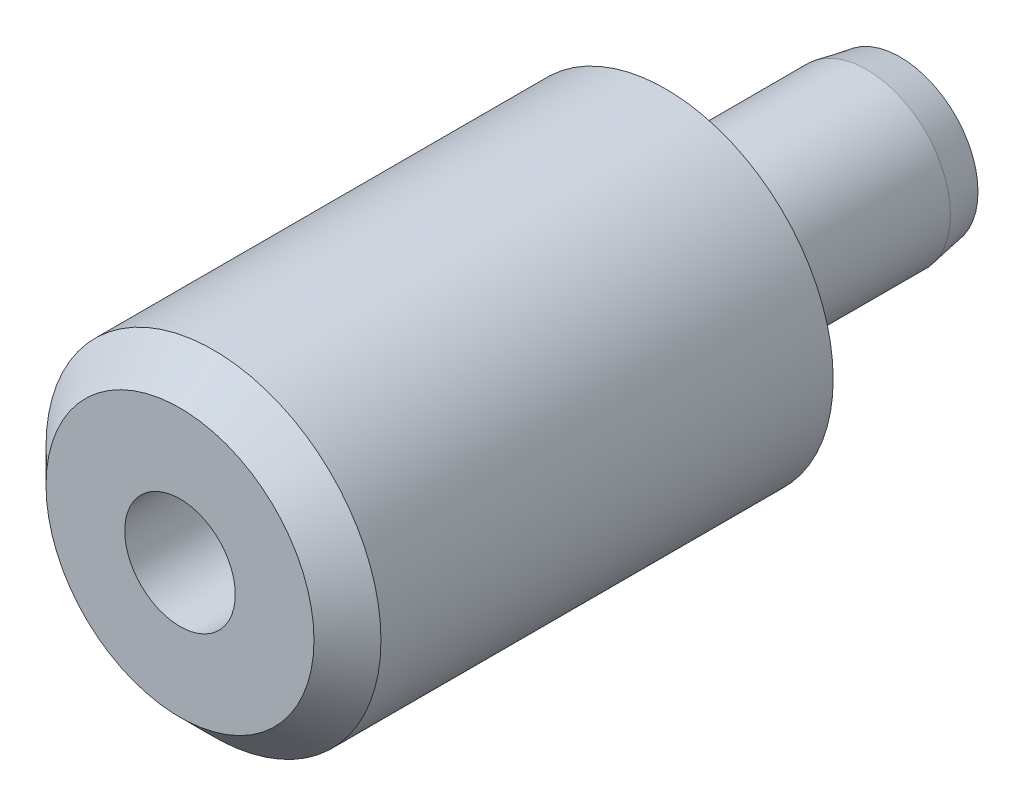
ISO-10303-21;
HEADER;
FILE_DESCRIPTION(('STEP AP214'),'2;1');
FILE_NAME('part.step','',(''),(''),'','','');
FILE_SCHEMA(('AUTOMOTIVE_DESIGN { 1 0 10303 214 1 1 1 1 }'));
ENDSEC;
DATA;
#1=APPLICATION_CONTEXT('core data for automotive mechanical design processes');
#2=APPLICATION_PROTOCOL_DEFINITION('international standard','automotive_design',2000,#1);
#3=PRODUCT_CONTEXT('',#1,'mechanical');
#4=PRODUCT('Part','Part','',(#3));
#5=PRODUCT_RELATED_PRODUCT_CATEGORY('part','',(#4));
#6=PRODUCT_DEFINITION_FORMATION('','',#4);
#7=PRODUCT_DEFINITION_CONTEXT('part definition',#1,'design');
#8=PRODUCT_DEFINITION('design','',#6,#7);
#9=PRODUCT_DEFINITION_SHAPE('','',#8);
#10=(LENGTH_UNIT() NAMED_UNIT(*) SI_UNIT(.MILLI.,.METRE.));
#11=(NAMED_UNIT(*) PLANE_ANGLE_UNIT() SI_UNIT($,.RADIAN.));
#12=(NAMED_UNIT(*) SI_UNIT($,.STERADIAN.) SOLID_ANGLE_UNIT());
#13=UNCERTAINTY_MEASURE_WITH_UNIT(LENGTH_MEASURE(1.E-05),#10,'distance_accuracy_value','');
#14=(GEOMETRIC_REPRESENTATION_CONTEXT(3) GLOBAL_UNCERTAINTY_ASSIGNED_CONTEXT((#13)) GLOBAL_UNIT_ASSIGNED_CONTEXT((#10,
#11,#12)) REPRESENTATION_CONTEXT('',''));
#15=CARTESIAN_POINT('',(0.,0.,0.));
#16=DIRECTION('',(0.,0.,1.));
#17=DIRECTION('',(1.,0.,0.));
#18=AXIS2_PLACEMENT_3D('',#15,#16,#17);
#19=CARTESIAN_POINT('',(0.,0.,0.5));
#20=DIRECTION('',(0.,0.,-1.));
#21=DIRECTION('',(-1.,0.,0.));
#22=AXIS2_PLACEMENT_3D('',#19,#20,#21);
#23=PLANE('',#22);
#24=CARTESIAN_POINT('',(0.,0.,0.5));
#25=DIRECTION('',(0.,0.,-1.));
#26=DIRECTION('',(-1.,0.,0.));
#27=AXIS2_PLACEMENT_3D('',#24,#25,#26);
#28=CIRCLE('',#27,3.3);
#29=CARTESIAN_POINT('',(-3.3,0.,0.5));
#30=VERTEX_POINT('',#29);
#31=EDGE_CURVE('E71',#30,#30,#28,.F.);
#32=ORIENTED_EDGE('',*,*,#31,.T.);
#33=EDGE_LOOP('',(#32));
#34=FACE_BOUND('',#33,.T.);
#35=CARTESIAN_POINT('',(0.,0.,0.5));
#36=DIRECTION('',(0.,0.,1.));
#37=DIRECTION('',(1.,0.,0.));
#38=AXIS2_PLACEMENT_3D('',#35,#36,#37);
#39=CIRCLE('',#38,5.);
#40=CARTESIAN_POINT('',(5.,0.,0.499999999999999));
#41=VERTEX_POINT('',#40);
#42=EDGE_CURVE('E68',#41,#41,#39,.T.);
#43=ORIENTED_EDGE('',*,*,#42,.F.);
#44=EDGE_LOOP('',(#43));
#45=FACE_BOUND('',#44,.T.);
#46=ADVANCED_FACE('F37',(#34,#45),#23,.T.);
#47=CARTESIAN_POINT('',(0.,0.,0.5));
#48=DIRECTION('',(0.,0.,1.));
#49=DIRECTION('',(1.,0.,0.));
#50=AXIS2_PLACEMENT_3D('',#47,#48,#49);
#51=CYLINDRICAL_SURFACE('',#50,5.);
#52=CARTESIAN_POINT('',(0.,0.,14.));
#53=DIRECTION('',(0.,0.,1.));
#54=DIRECTION('',(1.,0.,0.));
#55=AXIS2_PLACEMENT_3D('',#52,#53,#54);
#56=CIRCLE('',#55,5.);
#57=CARTESIAN_POINT('',(5.,0.,14.));
#58=VERTEX_POINT('',#57);
#59=EDGE_CURVE('E11',#58,#58,#56,.F.);
#60=ORIENTED_EDGE('',*,*,#59,.T.);
#61=EDGE_LOOP('',(#60));
#62=FACE_BOUND('',#61,.T.);
#63=ORIENTED_EDGE('',*,*,#42,.T.);
#64=EDGE_LOOP('',(#63));
#65=FACE_BOUND('',#64,.T.);
#66=ADVANCED_FACE('F91',(#62,#65),#51,.T.);
#67=CARTESIAN_POINT('',(0.,0.,15.));
#68=DIRECTION('',(0.,0.,1.));
#69=DIRECTION('',(1.,0.,0.));
#70=AXIS2_PLACEMENT_3D('',#67,#68,#69);
#71=PLANE('',#70);
#72=CARTESIAN_POINT('',(0.,0.,15.));
#73=DIRECTION('',(0.,0.,1.));
#74=DIRECTION('',(1.,0.,0.));
#75=AXIS2_PLACEMENT_3D('',#72,#73,#74);
#76=CIRCLE('',#75,4.);
#77=CARTESIAN_POINT('',(4.,0.,15.));
#78=VERTEX_POINT('',#77);
#79=EDGE_CURVE('E44',#78,#78,#76,.T.);
#80=ORIENTED_EDGE('',*,*,#79,.T.);
#81=EDGE_LOOP('',(#80));
#82=FACE_BOUND('',#81,.T.);
#83=CARTESIAN_POINT('',(0.,0.,15.));
#84=DIRECTION('',(0.,0.,1.));
#85=DIRECTION('',(1.,0.,0.));
#86=AXIS2_PLACEMENT_3D('',#83,#84,#85);
#87=CIRCLE('',#86,1.64999999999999);
#88=CARTESIAN_POINT('',(1.64999999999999,0.,15.));
#89=VERTEX_POINT('',#88);
#90=EDGE_CURVE('E58',#89,#89,#87,.T.);
#91=ORIENTED_EDGE('',*,*,#90,.F.);
#92=EDGE_LOOP('',(#91));
#93=FACE_BOUND('',#92,.T.);
#94=ADVANCED_FACE('F79',(#82,#93),#71,.T.);
#95=CARTESIAN_POINT('',(0.,0.,-6.5));
#96=DIRECTION('',(0.,0.,1.));
#97=DIRECTION('',(1.,0.,0.));
#98=AXIS2_PLACEMENT_3D('',#95,#96,#97);
#99=CYLINDRICAL_SURFACE('',#98,2.5);
#100=CARTESIAN_POINT('',(0.,0.,-0.3));
#101=DIRECTION('',(0.,0.,-1.));
#102=DIRECTION('',(-1.,0.,0.));
#103=AXIS2_PLACEMENT_3D('',#100,#101,#102);
#104=CIRCLE('',#103,2.5);
#105=CARTESIAN_POINT('',(-2.5,0.,-0.3));
#106=VERTEX_POINT('',#105);
#107=EDGE_CURVE('E74',#106,#106,#104,.T.);
#108=ORIENTED_EDGE('',*,*,#107,.T.);
#109=EDGE_LOOP('',(#108));
#110=FACE_BOUND('',#109,.T.);
#111=CARTESIAN_POINT('',(0.,0.,-5.5));
#112=DIRECTION('',(0.,0.,1.));
#113=DIRECTION('',(1.,0.,0.));
#114=AXIS2_PLACEMENT_3D('',#111,#112,#113);
#115=CIRCLE('',#114,2.5);
#116=CARTESIAN_POINT('',(2.5,0.,-5.5));
#117=VERTEX_POINT('',#116);
#118=EDGE_CURVE('E61',#117,#117,#115,.T.);
#119=ORIENTED_EDGE('',*,*,#118,.T.);
#120=EDGE_LOOP('',(#119));
#121=FACE_BOUND('',#120,.T.);
#122=ADVANCED_FACE('F103',(#110,#121),#99,.T.);
#123=CARTESIAN_POINT('',(0.,0.,-5.5));
#124=DIRECTION('',(0.,0.,1.));
#125=DIRECTION('',(1.,0.,0.));
#126=AXIS2_PLACEMENT_3D('',#123,#124,#125);
#127=CONICAL_SURFACE('',#126,2.5,0.174532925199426);
#128=CARTESIAN_POINT('',(0.,0.,-6.5));
#129=DIRECTION('',(0.,0.,1.));
#130=DIRECTION('',(1.,0.,0.));
#131=AXIS2_PLACEMENT_3D('',#128,#129,#130);
#132=CIRCLE('',#131,2.32367301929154);
#133=CARTESIAN_POINT('',(2.32367301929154,0.,-6.5));
#134=VERTEX_POINT('',#133);
#135=EDGE_CURVE('E57',#134,#134,#132,.T.);
#136=ORIENTED_EDGE('',*,*,#135,.T.);
#137=EDGE_LOOP('',(#136));
#138=FACE_BOUND('',#137,.T.);
#139=ORIENTED_EDGE('',*,*,#118,.F.);
#140=EDGE_LOOP('',(#139));
#141=FACE_BOUND('',#140,.T.);
#142=ADVANCED_FACE('F106',(#138,#141),#127,.T.);
#143=CARTESIAN_POINT('',(0.,0.,-6.5));
#144=DIRECTION('',(0.,0.,-1.));
#145=DIRECTION('',(-1.,0.,0.));
#146=AXIS2_PLACEMENT_3D('',#143,#144,#145);
#147=PLANE('',#146);
#148=ORIENTED_EDGE('',*,*,#135,.F.);
#149=EDGE_LOOP('',(#148));
#150=FACE_BOUND('',#149,.T.);
#151=ADVANCED_FACE('F51',(#150),#147,.T.);
#152=CARTESIAN_POINT('',(0.,0.,2.));
#153=DIRECTION('',(0.,0.,1.));
#154=DIRECTION('',(1.,0.,0.));
#155=AXIS2_PLACEMENT_3D('',#152,#153,#154);
#156=CONICAL_SURFACE('',#155,1.65,1.02974425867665);
#157=CARTESIAN_POINT('',(0.,0.,1.00857997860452));
#158=VERTEX_POINT('',#157);
#159=VERTEX_LOOP('',#158);
#160=FACE_BOUND('',#159,.T.);
#161=CARTESIAN_POINT('',(0.,0.,2.));
#162=DIRECTION('',(0.,0.,1.));
#163=DIRECTION('',(1.,0.,0.));
#164=AXIS2_PLACEMENT_3D('',#161,#162,#163);
#165=CIRCLE('',#164,1.65);
#166=CARTESIAN_POINT('',(1.65,0.,2.));
#167=VERTEX_POINT('',#166);
#168=EDGE_CURVE('E55',#167,#167,#165,.T.);
#169=ORIENTED_EDGE('',*,*,#168,.T.);
#170=EDGE_LOOP('',(#169));
#171=FACE_BOUND('',#170,.T.);
#172=ADVANCED_FACE('F47',(#160,#171),#156,.F.);
#173=CARTESIAN_POINT('',(0.,0.,15.));
#174=DIRECTION('',(0.,0.,1.));
#175=DIRECTION('',(1.,0.,0.));
#176=AXIS2_PLACEMENT_3D('',#173,#174,#175);
#177=CYLINDRICAL_SURFACE('',#176,1.64999999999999);
#178=ORIENTED_EDGE('',*,*,#168,.F.);
#179=EDGE_LOOP('',(#178));
#180=FACE_BOUND('',#179,.T.);
#181=ORIENTED_EDGE('',*,*,#90,.T.);
#182=EDGE_LOOP('',(#181));
#183=FACE_BOUND('',#182,.T.);
#184=ADVANCED_FACE('F50',(#180,#183),#177,.F.);
#185=CARTESIAN_POINT('',(0.,0.,-0.3));
#186=DIRECTION('',(0.,0.,-1.));
#187=DIRECTION('',(-1.,0.,0.));
#188=AXIS2_PLACEMENT_3D('',#185,#186,#187);
#189=TOROIDAL_SURFACE('',#188,3.3,0.8);
#190=ORIENTED_EDGE('',*,*,#107,.F.);
#191=EDGE_LOOP('',(#190));
#192=FACE_BOUND('',#191,.T.);
#193=ORIENTED_EDGE('',*,*,#31,.F.);
#194=EDGE_LOOP('',(#193));
#195=FACE_BOUND('',#194,.T.);
#196=ADVANCED_FACE('F83',(#192,#195),#189,.F.);
#197=CARTESIAN_POINT('',(0.,0.,15.));
#198=DIRECTION('',(0.,0.,-1.));
#199=DIRECTION('',(-1.,0.,0.));
#200=AXIS2_PLACEMENT_3D('',#197,#198,#199);
#201=CONICAL_SURFACE('',#200,4.,0.785398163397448);
#202=ORIENTED_EDGE('',*,*,#59,.F.);
#203=EDGE_LOOP('',(#202));
#204=FACE_BOUND('',#203,.T.);
#205=ORIENTED_EDGE('',*,*,#79,.F.);
#206=EDGE_LOOP('',(#205));
#207=FACE_BOUND('',#206,.T.);
#208=ADVANCED_FACE('F39',(#204,#207),#201,.T.);
#209=CLOSED_SHELL('',(#46,#66,#94,#122,#142,#151,#172,#184,#196,#208));
#210=MANIFOLD_SOLID_BREP('B2',#209);
#211=ADVANCED_BREP_SHAPE_REPRESENTATION('',(#18,#210),#14);
#212=SHAPE_DEFINITION_REPRESENTATION(#9,#211);
ENDSEC;
END-ISO-10303-21;
